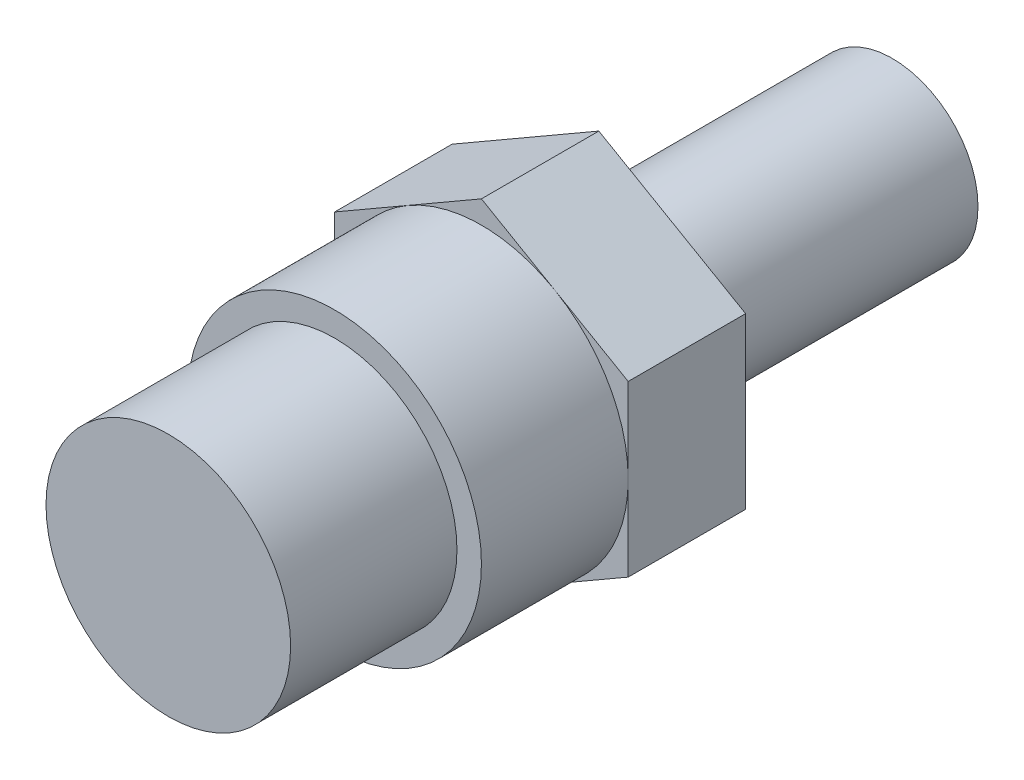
ISO-10303-21;
HEADER;
FILE_DESCRIPTION(('STEP AP214'),'2;1');
FILE_NAME('part.step','',(''),(''),'','','');
FILE_SCHEMA(('AUTOMOTIVE_DESIGN { 1 0 10303 214 1 1 1 1 }'));
ENDSEC;
DATA;
#1=APPLICATION_CONTEXT('core data for automotive mechanical design processes');
#2=APPLICATION_PROTOCOL_DEFINITION('international standard','automotive_design',2000,#1);
#3=PRODUCT_CONTEXT('',#1,'mechanical');
#4=PRODUCT('Part','Part','',(#3));
#5=PRODUCT_RELATED_PRODUCT_CATEGORY('part','',(#4));
#6=PRODUCT_DEFINITION_FORMATION('','',#4);
#7=PRODUCT_DEFINITION_CONTEXT('part definition',#1,'design');
#8=PRODUCT_DEFINITION('design','',#6,#7);
#9=PRODUCT_DEFINITION_SHAPE('','',#8);
#10=(LENGTH_UNIT() NAMED_UNIT(*) SI_UNIT(.MILLI.,.METRE.));
#11=(NAMED_UNIT(*) PLANE_ANGLE_UNIT() SI_UNIT($,.RADIAN.));
#12=(NAMED_UNIT(*) SI_UNIT($,.STERADIAN.) SOLID_ANGLE_UNIT());
#13=UNCERTAINTY_MEASURE_WITH_UNIT(LENGTH_MEASURE(1.E-05),#10,'distance_accuracy_value','');
#14=(GEOMETRIC_REPRESENTATION_CONTEXT(3) GLOBAL_UNCERTAINTY_ASSIGNED_CONTEXT((#13)) GLOBAL_UNIT_ASSIGNED_CONTEXT((#10,
#11,#12)) REPRESENTATION_CONTEXT('',''));
#15=CARTESIAN_POINT('',(0.,0.,0.));
#16=DIRECTION('',(0.,0.,1.));
#17=DIRECTION('',(1.,0.,0.));
#18=AXIS2_PLACEMENT_3D('',#15,#16,#17);
#19=CARTESIAN_POINT('',(-5.6566090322,-5.666378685,-19.05));
#20=DIRECTION('',(0.,0.,1.));
#21=DIRECTION('',(1.,0.,0.));
#22=AXIS2_PLACEMENT_3D('',#19,#20,#21);
#23=PLANE('',#22);
#24=CARTESIAN_POINT('',(0.,0.,-19.05));
#25=DIRECTION('',(0.,0.,1.));
#26=DIRECTION('',(1.,0.,0.));
#27=AXIS2_PLACEMENT_3D('',#24,#25,#26);
#28=CIRCLE('',#27,5.55625);
#29=CARTESIAN_POINT('',(5.55625,0.,-19.05));
#30=VERTEX_POINT('',#29);
#31=EDGE_CURVE('E20',#30,#30,#28,.T.);
#32=ORIENTED_EDGE('',*,*,#31,.F.);
#33=EDGE_LOOP('',(#32));
#34=FACE_BOUND('',#33,.T.);
#35=ADVANCED_FACE('F16',(#34),#23,.F.);
#36=CARTESIAN_POINT('',(0.,0.,-19.05));
#37=DIRECTION('',(0.,0.,1.));
#38=DIRECTION('',(1.,0.,0.));
#39=AXIS2_PLACEMENT_3D('',#36,#37,#38);
#40=CYLINDRICAL_SURFACE('',#39,5.55625);
#41=ORIENTED_EDGE('',*,*,#31,.T.);
#42=EDGE_LOOP('',(#41));
#43=FACE_BOUND('',#42,.T.);
#44=CARTESIAN_POINT('',(0.,0.,0.));
#45=DIRECTION('',(0.,0.,1.));
#46=DIRECTION('',(1.,0.,0.));
#47=AXIS2_PLACEMENT_3D('',#44,#45,#46);
#48=CIRCLE('',#47,5.55625);
#49=CARTESIAN_POINT('',(5.55625,0.,0.));
#50=VERTEX_POINT('',#49);
#51=EDGE_CURVE('E120',#50,#50,#48,.T.);
#52=ORIENTED_EDGE('',*,*,#51,.F.);
#53=EDGE_LOOP('',(#52));
#54=FACE_BOUND('',#53,.T.);
#55=ADVANCED_FACE('F130',(#43,#54),#40,.T.);
#56=CARTESIAN_POINT('',(9.525,-11.1305048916,0.));
#57=DIRECTION('',(0.,0.,-1.));
#58=DIRECTION('',(-1.,0.,0.));
#59=AXIS2_PLACEMENT_3D('',#56,#57,#58);
#60=PLANE('',#59);
#61=ORIENTED_EDGE('',*,*,#51,.T.);
#62=EDGE_LOOP('',(#61));
#63=FACE_BOUND('',#62,.T.);
#64=DIRECTION('',(0.,1.,0.));
#65=VECTOR('',#64,1.);
#66=CARTESIAN_POINT('',(-9.525,0.,0.));
#67=LINE('',#66,#65);
#68=CARTESIAN_POINT('',(-9.525,-5.4992613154,0.));
#69=VERTEX_POINT('',#68);
#70=CARTESIAN_POINT('',(-9.525,5.4992613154,0.));
#71=VERTEX_POINT('',#70);
#72=EDGE_CURVE('E210',#69,#71,#67,.T.);
#73=ORIENTED_EDGE('',*,*,#72,.T.);
#74=DIRECTION('',(0.866025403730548,0.500000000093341,0.));
#75=VECTOR('',#74,1.);
#76=CARTESIAN_POINT('',(-4.7625,8.2488919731,0.));
#77=LINE('',#76,#75);
#78=CARTESIAN_POINT('',(-3.32179936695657E-10,10.9985226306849,0.));
#79=VERTEX_POINT('',#78);
#80=EDGE_CURVE('E87',#71,#79,#77,.T.);
#81=ORIENTED_EDGE('',*,*,#80,.T.);
#82=DIRECTION('',(0.866025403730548,-0.500000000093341,0.));
#83=VECTOR('',#82,1.);
#84=CARTESIAN_POINT('',(4.7625,8.2488919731,0.));
#85=LINE('',#84,#83);
#86=CARTESIAN_POINT('',(9.525,5.4992613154,0.));
#87=VERTEX_POINT('',#86);
#88=EDGE_CURVE('E231',#79,#87,#85,.T.);
#89=ORIENTED_EDGE('',*,*,#88,.T.);
#90=DIRECTION('',(0.,-1.,0.));
#91=VECTOR('',#90,1.);
#92=CARTESIAN_POINT('',(9.525,0.,0.));
#93=LINE('',#92,#91);
#94=CARTESIAN_POINT('',(9.525,-5.4992613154,0.));
#95=VERTEX_POINT('',#94);
#96=EDGE_CURVE('E238',#87,#95,#93,.T.);
#97=ORIENTED_EDGE('',*,*,#96,.T.);
#98=DIRECTION('',(-0.866025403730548,-0.500000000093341,0.));
#99=VECTOR('',#98,1.);
#100=CARTESIAN_POINT('',(4.7625,-8.2488919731,0.));
#101=LINE('',#100,#99);
#102=CARTESIAN_POINT('',(0.,-10.9985226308,0.));
#103=VERTEX_POINT('',#102);
#104=EDGE_CURVE('E244',#95,#103,#101,.T.);
#105=ORIENTED_EDGE('',*,*,#104,.T.);
#106=DIRECTION('',(-0.866025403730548,0.500000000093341,0.));
#107=VECTOR('',#106,1.);
#108=CARTESIAN_POINT('',(-4.7625,-8.2488919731,0.));
#109=LINE('',#108,#107);
#110=EDGE_CURVE('E122',#103,#69,#109,.T.);
#111=ORIENTED_EDGE('',*,*,#110,.T.);
#112=EDGE_LOOP('',(#73,#81,#89,#97,#105,#111));
#113=FACE_BOUND('',#112,.T.);
#114=ADVANCED_FACE('F139',(#63,#113),#60,.T.);
#115=CARTESIAN_POINT('',(0.,-10.9985226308,0.));
#116=DIRECTION('',(0.500000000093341,0.866025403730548,0.));
#117=DIRECTION('',(-0.866025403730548,0.500000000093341,0.));
#118=AXIS2_PLACEMENT_3D('',#115,#116,#117);
#119=PLANE('',#118);
#120=DIRECTION('',(0.,0.,1.));
#121=VECTOR('',#120,1.);
#122=CARTESIAN_POINT('',(0.,-10.9985226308,3.81));
#123=LINE('',#122,#121);
#124=CARTESIAN_POINT('',(0.,-10.9985226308,7.62));
#125=VERTEX_POINT('',#124);
#126=EDGE_CURVE('E74',#103,#125,#123,.T.);
#127=ORIENTED_EDGE('',*,*,#126,.T.);
#128=DIRECTION('',(-0.866025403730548,0.500000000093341,0.));
#129=VECTOR('',#128,1.);
#130=CARTESIAN_POINT('',(0.,-10.9985226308,7.62));
#131=LINE('',#130,#129);
#132=CARTESIAN_POINT('',(-4.76250000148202,-8.24889197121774,7.62));
#133=VERTEX_POINT('',#132);
#134=EDGE_CURVE('E67',#125,#133,#131,.T.);
#135=ORIENTED_EDGE('',*,*,#134,.T.);
#136=DIRECTION('',(-0.866025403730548,0.500000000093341,0.));
#137=VECTOR('',#136,1.);
#138=CARTESIAN_POINT('',(0.,-10.9985226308,7.62));
#139=LINE('',#138,#137);
#140=CARTESIAN_POINT('',(-9.525,-5.4992613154,7.62));
#141=VERTEX_POINT('',#140);
#142=EDGE_CURVE('E71',#133,#141,#139,.T.);
#143=ORIENTED_EDGE('',*,*,#142,.T.);
#144=DIRECTION('',(0.,0.,-1.));
#145=VECTOR('',#144,1.);
#146=CARTESIAN_POINT('',(-9.525,-5.4992613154,3.81));
#147=LINE('',#146,#145);
#148=EDGE_CURVE('E220',#141,#69,#147,.T.);
#149=ORIENTED_EDGE('',*,*,#148,.T.);
#150=ORIENTED_EDGE('',*,*,#110,.F.);
#151=EDGE_LOOP('',(#127,#135,#143,#149,#150));
#152=FACE_BOUND('',#151,.T.);
#153=ADVANCED_FACE('F69',(#152),#119,.F.);
#154=CARTESIAN_POINT('',(9.525,-5.4992613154,0.));
#155=DIRECTION('',(-0.500000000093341,0.866025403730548,0.));
#156=DIRECTION('',(-0.866025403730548,-0.500000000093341,0.));
#157=AXIS2_PLACEMENT_3D('',#154,#155,#156);
#158=PLANE('',#157);
#159=DIRECTION('',(0.,0.,1.));
#160=VECTOR('',#159,1.);
#161=CARTESIAN_POINT('',(9.525,-5.4992613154,3.81));
#162=LINE('',#161,#160);
#163=CARTESIAN_POINT('',(9.525,-5.4992613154,7.62));
#164=VERTEX_POINT('',#163);
#165=EDGE_CURVE('E241',#95,#164,#162,.T.);
#166=ORIENTED_EDGE('',*,*,#165,.T.);
#167=DIRECTION('',(-0.866025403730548,-0.500000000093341,0.));
#168=VECTOR('',#167,1.);
#169=CARTESIAN_POINT('',(9.525,-5.4992613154,7.62));
#170=LINE('',#169,#168);
#171=CARTESIAN_POINT('',(4.76249999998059,-8.24889197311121,7.62));
#172=VERTEX_POINT('',#171);
#173=EDGE_CURVE('E118',#164,#172,#170,.T.);
#174=ORIENTED_EDGE('',*,*,#173,.T.);
#175=DIRECTION('',(-0.866025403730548,-0.500000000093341,0.));
#176=VECTOR('',#175,1.);
#177=CARTESIAN_POINT('',(9.525,-5.4992613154,7.62));
#178=LINE('',#177,#176);
#179=EDGE_CURVE('E80',#172,#125,#178,.T.);
#180=ORIENTED_EDGE('',*,*,#179,.T.);
#181=ORIENTED_EDGE('',*,*,#126,.F.);
#182=ORIENTED_EDGE('',*,*,#104,.F.);
#183=EDGE_LOOP('',(#166,#174,#180,#181,#182));
#184=FACE_BOUND('',#183,.T.);
#185=ADVANCED_FACE('F196',(#184),#158,.F.);
#186=CARTESIAN_POINT('',(9.525,5.4992613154,0.));
#187=DIRECTION('',(-1.,0.,0.));
#188=DIRECTION('',(0.,-1.,0.));
#189=AXIS2_PLACEMENT_3D('',#186,#187,#188);
#190=PLANE('',#189);
#191=DIRECTION('',(0.,0.,1.));
#192=VECTOR('',#191,1.);
#193=CARTESIAN_POINT('',(9.525,5.4992613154,3.81));
#194=LINE('',#193,#192);
#195=CARTESIAN_POINT('',(9.525,5.4992613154,7.62));
#196=VERTEX_POINT('',#195);
#197=EDGE_CURVE('E233',#87,#196,#194,.T.);
#198=ORIENTED_EDGE('',*,*,#197,.T.);
#199=DIRECTION('',(0.,-1.,0.));
#200=VECTOR('',#199,1.);
#201=CARTESIAN_POINT('',(9.525,4.1244459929,7.62));
#202=LINE('',#201,#200);
#203=CARTESIAN_POINT('',(9.525,1.10225639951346E-09,7.62));
#204=VERTEX_POINT('',#203);
#205=EDGE_CURVE('E114',#196,#204,#202,.T.);
#206=ORIENTED_EDGE('',*,*,#205,.T.);
#207=DIRECTION('',(0.,-1.,0.));
#208=VECTOR('',#207,1.);
#209=CARTESIAN_POINT('',(9.525,-4.1244459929,7.62));
#210=LINE('',#209,#208);
#211=EDGE_CURVE('E79',#204,#164,#210,.T.);
#212=ORIENTED_EDGE('',*,*,#211,.T.);
#213=ORIENTED_EDGE('',*,*,#165,.F.);
#214=ORIENTED_EDGE('',*,*,#96,.F.);
#215=EDGE_LOOP('',(#198,#206,#212,#213,#214));
#216=FACE_BOUND('',#215,.T.);
#217=ADVANCED_FACE('F192',(#216),#190,.F.);
#218=CARTESIAN_POINT('',(0.,10.9985226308,0.));
#219=DIRECTION('',(-0.500000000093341,-0.866025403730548,0.));
#220=DIRECTION('',(0.866025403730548,-0.500000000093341,0.));
#221=AXIS2_PLACEMENT_3D('',#218,#219,#220);
#222=PLANE('',#221);
#223=DIRECTION('',(0.,0.,1.));
#224=VECTOR('',#223,1.);
#225=CARTESIAN_POINT('',(0.,10.9985226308,3.81));
#226=LINE('',#225,#224);
#227=CARTESIAN_POINT('',(0.,10.9985226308,7.62));
#228=VERTEX_POINT('',#227);
#229=EDGE_CURVE('E219',#79,#228,#226,.T.);
#230=ORIENTED_EDGE('',*,*,#229,.T.);
#231=DIRECTION('',(0.866025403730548,-0.500000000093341,0.));
#232=VECTOR('',#231,1.);
#233=CARTESIAN_POINT('',(0.,10.9985226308,7.62));
#234=LINE('',#233,#232);
#235=CARTESIAN_POINT('',(4.76249999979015,8.24889197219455,7.62));
#236=VERTEX_POINT('',#235);
#237=EDGE_CURVE('E109',#228,#236,#234,.T.);
#238=ORIENTED_EDGE('',*,*,#237,.T.);
#239=DIRECTION('',(0.866025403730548,-0.500000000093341,0.));
#240=VECTOR('',#239,1.);
#241=CARTESIAN_POINT('',(0.,10.9985226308,7.62));
#242=LINE('',#241,#240);
#243=EDGE_CURVE('E115',#236,#196,#242,.T.);
#244=ORIENTED_EDGE('',*,*,#243,.T.);
#245=ORIENTED_EDGE('',*,*,#197,.F.);
#246=ORIENTED_EDGE('',*,*,#88,.F.);
#247=EDGE_LOOP('',(#230,#238,#244,#245,#246));
#248=FACE_BOUND('',#247,.T.);
#249=ADVANCED_FACE('F189',(#248),#222,.F.);
#250=CARTESIAN_POINT('',(-9.525,-5.4992613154,0.));
#251=DIRECTION('',(1.,0.,0.));
#252=DIRECTION('',(0.,1.,0.));
#253=AXIS2_PLACEMENT_3D('',#250,#251,#252);
#254=PLANE('',#253);
#255=ORIENTED_EDGE('',*,*,#148,.F.);
#256=DIRECTION('',(0.,1.,0.));
#257=VECTOR('',#256,1.);
#258=CARTESIAN_POINT('',(-9.525,-4.1244459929,7.62));
#259=LINE('',#258,#257);
#260=CARTESIAN_POINT('',(-9.525,-3.05586648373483E-09,7.62));
#261=VERTEX_POINT('',#260);
#262=EDGE_CURVE('E35',#141,#261,#259,.T.);
#263=ORIENTED_EDGE('',*,*,#262,.T.);
#264=DIRECTION('',(0.,1.,0.));
#265=VECTOR('',#264,1.);
#266=CARTESIAN_POINT('',(-9.525,4.1244459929,7.62));
#267=LINE('',#266,#265);
#268=CARTESIAN_POINT('',(-9.525,5.4992613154,7.62));
#269=VERTEX_POINT('',#268);
#270=EDGE_CURVE('E105',#261,#269,#267,.T.);
#271=ORIENTED_EDGE('',*,*,#270,.T.);
#272=DIRECTION('',(0.,0.,-1.));
#273=VECTOR('',#272,1.);
#274=CARTESIAN_POINT('',(-9.525,5.4992613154,3.81));
#275=LINE('',#274,#273);
#276=EDGE_CURVE('E223',#269,#71,#275,.T.);
#277=ORIENTED_EDGE('',*,*,#276,.T.);
#278=ORIENTED_EDGE('',*,*,#72,.F.);
#279=EDGE_LOOP('',(#255,#263,#271,#277,#278));
#280=FACE_BOUND('',#279,.T.);
#281=ADVANCED_FACE('F185',(#280),#254,.F.);
#282=CARTESIAN_POINT('',(-9.525,5.4992613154,0.));
#283=DIRECTION('',(0.500000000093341,-0.866025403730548,0.));
#284=DIRECTION('',(0.866025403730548,0.500000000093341,0.));
#285=AXIS2_PLACEMENT_3D('',#282,#283,#284);
#286=PLANE('',#285);
#287=ORIENTED_EDGE('',*,*,#276,.F.);
#288=DIRECTION('',(0.866025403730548,0.500000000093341,0.));
#289=VECTOR('',#288,1.);
#290=CARTESIAN_POINT('',(-9.525,5.4992613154,7.62));
#291=LINE('',#290,#289);
#292=CARTESIAN_POINT('',(-4.76249999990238,8.24889197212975,7.62));
#293=VERTEX_POINT('',#292);
#294=EDGE_CURVE('E103',#269,#293,#291,.T.);
#295=ORIENTED_EDGE('',*,*,#294,.T.);
#296=DIRECTION('',(0.866025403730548,0.500000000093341,0.));
#297=VECTOR('',#296,1.);
#298=CARTESIAN_POINT('',(-9.525,5.4992613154,7.62));
#299=LINE('',#298,#297);
#300=EDGE_CURVE('E111',#293,#228,#299,.T.);
#301=ORIENTED_EDGE('',*,*,#300,.T.);
#302=ORIENTED_EDGE('',*,*,#229,.F.);
#303=ORIENTED_EDGE('',*,*,#80,.F.);
#304=EDGE_LOOP('',(#287,#295,#301,#302,#303));
#305=FACE_BOUND('',#304,.T.);
#306=ADVANCED_FACE('F182',(#305),#286,.F.);
#307=CARTESIAN_POINT('',(-4.733925,-8.2983853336,7.62));
#308=DIRECTION('',(0.,0.,-1.));
#309=DIRECTION('',(-1.,0.,0.));
#310=AXIS2_PLACEMENT_3D('',#307,#308,#309);
#311=PLANE('',#310);
#312=ORIENTED_EDGE('',*,*,#262,.F.);
#313=ORIENTED_EDGE('',*,*,#142,.F.);
#314=CARTESIAN_POINT('',(0.,0.,7.62));
#315=DIRECTION('',(0.,0.,-1.));
#316=DIRECTION('',(-1.,0.,0.));
#317=AXIS2_PLACEMENT_3D('',#314,#315,#316);
#318=CIRCLE('',#317,9.525);
#319=EDGE_CURVE('E85',#261,#133,#318,.F.);
#320=ORIENTED_EDGE('',*,*,#319,.F.);
#321=EDGE_LOOP('',(#312,#313,#320));
#322=FACE_BOUND('',#321,.T.);
#323=ADVANCED_FACE('F83',(#322),#311,.F.);
#324=CARTESIAN_POINT('',(4.81965,-11.0150204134,7.62));
#325=DIRECTION('',(0.,0.,-1.));
#326=DIRECTION('',(-1.,0.,0.));
#327=AXIS2_PLACEMENT_3D('',#324,#325,#326);
#328=PLANE('',#327);
#329=ORIENTED_EDGE('',*,*,#134,.F.);
#330=ORIENTED_EDGE('',*,*,#179,.F.);
#331=CARTESIAN_POINT('',(0.,0.,7.62));
#332=DIRECTION('',(0.,0.,-1.));
#333=DIRECTION('',(-1.,0.,0.));
#334=AXIS2_PLACEMENT_3D('',#331,#332,#333);
#335=CIRCLE('',#334,9.525);
#336=EDGE_CURVE('E90',#133,#172,#335,.F.);
#337=ORIENTED_EDGE('',*,*,#336,.F.);
#338=EDGE_LOOP('',(#329,#330,#337));
#339=FACE_BOUND('',#338,.T.);
#340=ADVANCED_FACE('F91',(#339),#328,.F.);
#341=CARTESIAN_POINT('',(9.525,-8.2983853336,7.62));
#342=DIRECTION('',(0.,0.,-1.));
#343=DIRECTION('',(-1.,0.,0.));
#344=AXIS2_PLACEMENT_3D('',#341,#342,#343);
#345=PLANE('',#344);
#346=ORIENTED_EDGE('',*,*,#173,.F.);
#347=ORIENTED_EDGE('',*,*,#211,.F.);
#348=CARTESIAN_POINT('',(0.,0.,7.62));
#349=DIRECTION('',(0.,0.,-1.));
#350=DIRECTION('',(-1.,0.,0.));
#351=AXIS2_PLACEMENT_3D('',#348,#349,#350);
#352=CIRCLE('',#351,9.525);
#353=EDGE_CURVE('E95',#172,#204,#352,.F.);
#354=ORIENTED_EDGE('',*,*,#353,.F.);
#355=EDGE_LOOP('',(#346,#347,#354));
#356=FACE_BOUND('',#355,.T.);
#357=ADVANCED_FACE('F173',(#356),#345,.F.);
#358=CARTESIAN_POINT('',(9.525,-0.0494933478,7.62));
#359=DIRECTION('',(0.,0.,-1.));
#360=DIRECTION('',(-1.,0.,0.));
#361=AXIS2_PLACEMENT_3D('',#358,#359,#360);
#362=PLANE('',#361);
#363=ORIENTED_EDGE('',*,*,#205,.F.);
#364=ORIENTED_EDGE('',*,*,#243,.F.);
#365=CARTESIAN_POINT('',(0.,0.,7.62));
#366=DIRECTION('',(0.,0.,-1.));
#367=DIRECTION('',(-1.,0.,0.));
#368=AXIS2_PLACEMENT_3D('',#365,#366,#367);
#369=CIRCLE('',#368,9.525);
#370=EDGE_CURVE('E256',#204,#236,#369,.F.);
#371=ORIENTED_EDGE('',*,*,#370,.F.);
#372=EDGE_LOOP('',(#363,#364,#371));
#373=FACE_BOUND('',#372,.T.);
#374=ADVANCED_FACE('F166',(#373),#362,.F.);
#375=CARTESIAN_POINT('',(4.81965,8.2323941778,7.62));
#376=DIRECTION('',(0.,0.,-1.));
#377=DIRECTION('',(-1.,0.,0.));
#378=AXIS2_PLACEMENT_3D('',#375,#376,#377);
#379=PLANE('',#378);
#380=ORIENTED_EDGE('',*,*,#237,.F.);
#381=ORIENTED_EDGE('',*,*,#300,.F.);
#382=CARTESIAN_POINT('',(0.,0.,7.62));
#383=DIRECTION('',(0.,0.,-1.));
#384=DIRECTION('',(-1.,0.,0.));
#385=AXIS2_PLACEMENT_3D('',#382,#383,#384);
#386=CIRCLE('',#385,9.525);
#387=EDGE_CURVE('E254',#236,#293,#386,.F.);
#388=ORIENTED_EDGE('',*,*,#387,.F.);
#389=EDGE_LOOP('',(#380,#381,#388));
#390=FACE_BOUND('',#389,.T.);
#391=ADVANCED_FACE('F160',(#390),#379,.F.);
#392=CARTESIAN_POINT('',(-4.733925,-0.0494933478,7.62));
#393=DIRECTION('',(0.,0.,-1.));
#394=DIRECTION('',(-1.,0.,0.));
#395=AXIS2_PLACEMENT_3D('',#392,#393,#394);
#396=PLANE('',#395);
#397=ORIENTED_EDGE('',*,*,#294,.F.);
#398=ORIENTED_EDGE('',*,*,#270,.F.);
#399=CARTESIAN_POINT('',(0.,0.,7.62));
#400=DIRECTION('',(0.,0.,-1.));
#401=DIRECTION('',(-1.,0.,0.));
#402=AXIS2_PLACEMENT_3D('',#399,#400,#401);
#403=CIRCLE('',#402,9.525);
#404=EDGE_CURVE('E102',#293,#261,#403,.F.);
#405=ORIENTED_EDGE('',*,*,#404,.F.);
#406=EDGE_LOOP('',(#397,#398,#405));
#407=FACE_BOUND('',#406,.T.);
#408=ADVANCED_FACE('F154',(#407),#396,.F.);
#409=CARTESIAN_POINT('',(0.,0.,17.145));
#410=DIRECTION('',(0.,0.,-1.));
#411=DIRECTION('',(-1.,0.,0.));
#412=AXIS2_PLACEMENT_3D('',#409,#410,#411);
#413=CYLINDRICAL_SURFACE('',#412,9.525);
#414=ORIENTED_EDGE('',*,*,#353,.T.);
#415=ORIENTED_EDGE('',*,*,#370,.T.);
#416=ORIENTED_EDGE('',*,*,#387,.T.);
#417=ORIENTED_EDGE('',*,*,#404,.T.);
#418=ORIENTED_EDGE('',*,*,#319,.T.);
#419=ORIENTED_EDGE('',*,*,#336,.T.);
#420=EDGE_LOOP('',(#414,#415,#416,#417,#418,#419));
#421=FACE_BOUND('',#420,.T.);
#422=CARTESIAN_POINT('',(0.,0.,17.145));
#423=DIRECTION('',(0.,0.,-1.));
#424=DIRECTION('',(-1.,0.,0.));
#425=AXIS2_PLACEMENT_3D('',#422,#423,#424);
#426=CIRCLE('',#425,9.525);
#427=CARTESIAN_POINT('',(-9.525,0.,17.145));
#428=VERTEX_POINT('',#427);
#429=EDGE_CURVE('E250',#428,#428,#426,.F.);
#430=ORIENTED_EDGE('',*,*,#429,.F.);
#431=EDGE_LOOP('',(#430));
#432=FACE_BOUND('',#431,.T.);
#433=ADVANCED_FACE('F98',(#421,#432),#413,.T.);
#434=CARTESIAN_POINT('',(-8.03275,-8.0603904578,27.94));
#435=DIRECTION('',(0.,0.,1.));
#436=DIRECTION('',(1.,0.,0.));
#437=AXIS2_PLACEMENT_3D('',#434,#435,#436);
#438=PLANE('',#437);
#439=CARTESIAN_POINT('',(0.,0.,27.94));
#440=DIRECTION('',(0.,0.,-1.));
#441=DIRECTION('',(-1.,0.,0.));
#442=AXIS2_PLACEMENT_3D('',#439,#440,#441);
#443=CIRCLE('',#442,7.9375);
#444=CARTESIAN_POINT('',(-7.9375,0.,27.94));
#445=VERTEX_POINT('',#444);
#446=EDGE_CURVE('E26',#445,#445,#443,.T.);
#447=ORIENTED_EDGE('',*,*,#446,.F.);
#448=EDGE_LOOP('',(#447));
#449=FACE_BOUND('',#448,.T.);
#450=ADVANCED_FACE('F149',(#449),#438,.T.);
#451=CARTESIAN_POINT('',(-9.6970440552,-9.7137920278,17.145));
#452=DIRECTION('',(0.,0.,1.));
#453=DIRECTION('',(1.,0.,0.));
#454=AXIS2_PLACEMENT_3D('',#451,#452,#453);
#455=PLANE('',#454);
#456=CARTESIAN_POINT('',(0.,0.,17.145));
#457=DIRECTION('',(0.,0.,-1.));
#458=DIRECTION('',(-1.,0.,0.));
#459=AXIS2_PLACEMENT_3D('',#456,#457,#458);
#460=CIRCLE('',#459,7.9375);
#461=CARTESIAN_POINT('',(-7.9375,0.,17.145));
#462=VERTEX_POINT('',#461);
#463=EDGE_CURVE('E11',#462,#462,#460,.F.);
#464=ORIENTED_EDGE('',*,*,#463,.F.);
#465=EDGE_LOOP('',(#464));
#466=FACE_BOUND('',#465,.T.);
#467=ORIENTED_EDGE('',*,*,#429,.T.);
#468=EDGE_LOOP('',(#467));
#469=FACE_BOUND('',#468,.T.);
#470=ADVANCED_FACE('F18',(#466,#469),#455,.T.);
#471=CARTESIAN_POINT('',(0.,0.,27.94));
#472=DIRECTION('',(0.,0.,-1.));
#473=DIRECTION('',(-1.,0.,0.));
#474=AXIS2_PLACEMENT_3D('',#471,#472,#473);
#475=CYLINDRICAL_SURFACE('',#474,7.9375);
#476=ORIENTED_EDGE('',*,*,#463,.T.);
#477=EDGE_LOOP('',(#476));
#478=FACE_BOUND('',#477,.T.);
#479=ORIENTED_EDGE('',*,*,#446,.T.);
#480=EDGE_LOOP('',(#479));
#481=FACE_BOUND('',#480,.T.);
#482=ADVANCED_FACE('F143',(#478,#481),#475,.T.);
#483=CLOSED_SHELL('',(#35,#55,#114,#153,#185,#217,#249,#281,#306,#323,#340,#357,#374,#391,#408,
#433,#450,#470,#482));
#484=MANIFOLD_SOLID_BREP('B1',#483);
#485=ADVANCED_BREP_SHAPE_REPRESENTATION('',(#18,#484),#14);
#486=SHAPE_DEFINITION_REPRESENTATION(#9,#485);
ENDSEC;
END-ISO-10303-21;
